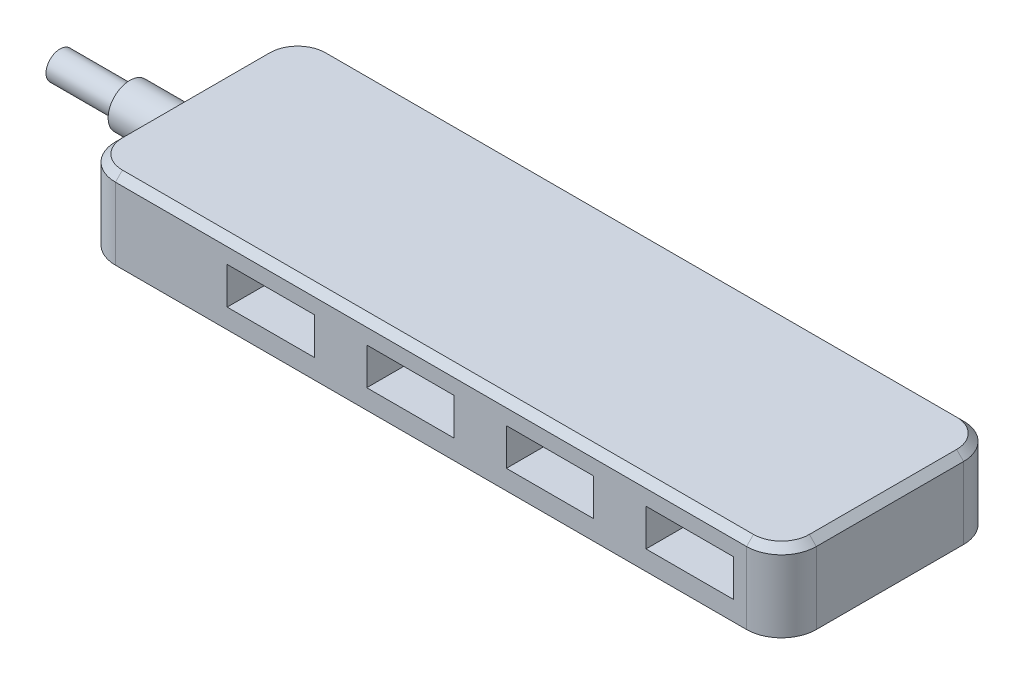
ISO-10303-21;
HEADER;
FILE_DESCRIPTION(('STEP AP214'),'2;1');
FILE_NAME('part.step','',(''),(''),'','','');
FILE_SCHEMA(('AUTOMOTIVE_DESIGN { 1 0 10303 214 1 1 1 1 }'));
ENDSEC;
DATA;
#1=APPLICATION_CONTEXT('core data for automotive mechanical design processes');
#2=APPLICATION_PROTOCOL_DEFINITION('international standard','automotive_design',2000,#1);
#3=PRODUCT_CONTEXT('',#1,'mechanical');
#4=PRODUCT('Part','Part','',(#3));
#5=PRODUCT_RELATED_PRODUCT_CATEGORY('part','',(#4));
#6=PRODUCT_DEFINITION_FORMATION('','',#4);
#7=PRODUCT_DEFINITION_CONTEXT('part definition',#1,'design');
#8=PRODUCT_DEFINITION('design','',#6,#7);
#9=PRODUCT_DEFINITION_SHAPE('','',#8);
#10=(LENGTH_UNIT() NAMED_UNIT(*) SI_UNIT(.MILLI.,.METRE.));
#11=(NAMED_UNIT(*) PLANE_ANGLE_UNIT() SI_UNIT($,.RADIAN.));
#12=(NAMED_UNIT(*) SI_UNIT($,.STERADIAN.) SOLID_ANGLE_UNIT());
#13=UNCERTAINTY_MEASURE_WITH_UNIT(LENGTH_MEASURE(1.E-05),#10,'distance_accuracy_value','');
#14=(GEOMETRIC_REPRESENTATION_CONTEXT(3) GLOBAL_UNCERTAINTY_ASSIGNED_CONTEXT((#13)) GLOBAL_UNIT_ASSIGNED_CONTEXT((#10,
#11,#12)) REPRESENTATION_CONTEXT('',''));
#15=CARTESIAN_POINT('',(0.,0.,0.));
#16=DIRECTION('',(0.,0.,1.));
#17=DIRECTION('',(1.,0.,0.));
#18=AXIS2_PLACEMENT_3D('',#15,#16,#17);
#19=CARTESIAN_POINT('',(50.2,11.3,15.55));
#20=DIRECTION('',(-1.,0.,0.));
#21=DIRECTION('',(0.,0.,1.));
#22=AXIS2_PLACEMENT_3D('',#19,#20,#21);
#23=PLANE('',#22);
#24=DIRECTION('',(0.,-1.,0.));
#25=VECTOR('',#24,1.);
#26=CARTESIAN_POINT('',(50.2,11.3,-10.55));
#27=LINE('',#26,#25);
#28=CARTESIAN_POINT('',(50.2,0.,-10.55));
#29=VERTEX_POINT('',#28);
#30=CARTESIAN_POINT('',(50.2,10.3,-10.55));
#31=VERTEX_POINT('',#30);
#32=EDGE_CURVE('E399',#29,#31,#27,.F.);
#33=ORIENTED_EDGE('',*,*,#32,.T.);
#34=DIRECTION('',(0.,0.,1.));
#35=VECTOR('',#34,1.);
#36=CARTESIAN_POINT('',(50.2,10.3,15.55));
#37=LINE('',#36,#35);
#38=CARTESIAN_POINT('',(50.2,10.3,10.55));
#39=VERTEX_POINT('',#38);
#40=EDGE_CURVE('E426',#31,#39,#37,.T.);
#41=ORIENTED_EDGE('',*,*,#40,.T.);
#42=DIRECTION('',(0.,-1.,0.));
#43=VECTOR('',#42,1.);
#44=CARTESIAN_POINT('',(50.2,11.3,10.55));
#45=LINE('',#44,#43);
#46=CARTESIAN_POINT('',(50.2,0.,10.55));
#47=VERTEX_POINT('',#46);
#48=EDGE_CURVE('E397',#39,#47,#45,.T.);
#49=ORIENTED_EDGE('',*,*,#48,.T.);
#50=DIRECTION('',(0.,0.,-1.));
#51=VECTOR('',#50,1.);
#52=CARTESIAN_POINT('',(50.2,0.,15.55));
#53=LINE('',#52,#51);
#54=EDGE_CURVE('E361',#47,#29,#53,.T.);
#55=ORIENTED_EDGE('',*,*,#54,.T.);
#56=EDGE_LOOP('',(#33,#41,#49,#55));
#57=FACE_BOUND('',#56,.T.);
#58=ADVANCED_FACE('F39',(#57),#23,.F.);
#59=CARTESIAN_POINT('',(-50.2,11.3,-15.55));
#60=DIRECTION('',(0.,0.,1.));
#61=DIRECTION('',(1.,0.,0.));
#62=AXIS2_PLACEMENT_3D('',#59,#60,#61);
#63=PLANE('',#62);
#64=DIRECTION('',(0.,-1.,0.));
#65=VECTOR('',#64,1.);
#66=CARTESIAN_POINT('',(-45.2,11.3,-15.55));
#67=LINE('',#66,#65);
#68=CARTESIAN_POINT('',(-45.2,0.,-15.55));
#69=VERTEX_POINT('',#68);
#70=CARTESIAN_POINT('',(-45.2,10.3,-15.55));
#71=VERTEX_POINT('',#70);
#72=EDGE_CURVE('E394',#69,#71,#67,.F.);
#73=ORIENTED_EDGE('',*,*,#72,.T.);
#74=DIRECTION('',(1.,0.,0.));
#75=VECTOR('',#74,1.);
#76=CARTESIAN_POINT('',(-50.2,10.3,-15.55));
#77=LINE('',#76,#75);
#78=CARTESIAN_POINT('',(45.2,10.3,-15.55));
#79=VERTEX_POINT('',#78);
#80=EDGE_CURVE('E422',#71,#79,#77,.T.);
#81=ORIENTED_EDGE('',*,*,#80,.T.);
#82=DIRECTION('',(0.,-1.,0.));
#83=VECTOR('',#82,1.);
#84=CARTESIAN_POINT('',(45.2,11.3,-15.55));
#85=LINE('',#84,#83);
#86=CARTESIAN_POINT('',(45.2,0.,-15.55));
#87=VERTEX_POINT('',#86);
#88=EDGE_CURVE('E392',#79,#87,#85,.T.);
#89=ORIENTED_EDGE('',*,*,#88,.T.);
#90=DIRECTION('',(-1.,0.,0.));
#91=VECTOR('',#90,1.);
#92=CARTESIAN_POINT('',(-50.2,0.,-15.55));
#93=LINE('',#92,#91);
#94=EDGE_CURVE('E364',#87,#69,#93,.T.);
#95=ORIENTED_EDGE('',*,*,#94,.T.);
#96=EDGE_LOOP('',(#73,#81,#89,#95));
#97=FACE_BOUND('',#96,.T.);
#98=ADVANCED_FACE('F519',(#97),#63,.F.);
#99=CARTESIAN_POINT('',(-50.2,11.3,15.55));
#100=DIRECTION('',(1.,0.,0.));
#101=DIRECTION('',(0.,0.,-1.));
#102=AXIS2_PLACEMENT_3D('',#99,#100,#101);
#103=PLANE('',#102);
#104=CARTESIAN_POINT('',(-50.2,5.3,0.));
#105=DIRECTION('',(1.,0.,0.));
#106=DIRECTION('',(0.,0.,-1.));
#107=AXIS2_PLACEMENT_3D('',#104,#105,#106);
#108=CIRCLE('',#107,3.1);
#109=CARTESIAN_POINT('',(-50.2,5.3,-3.1));
#110=VERTEX_POINT('',#109);
#111=EDGE_CURVE('E44',#110,#110,#108,.F.);
#112=ORIENTED_EDGE('',*,*,#111,.F.);
#113=EDGE_LOOP('',(#112));
#114=FACE_BOUND('',#113,.T.);
#115=DIRECTION('',(0.,-1.,0.));
#116=VECTOR('',#115,1.);
#117=CARTESIAN_POINT('',(-50.2,11.3,10.55));
#118=LINE('',#117,#116);
#119=CARTESIAN_POINT('',(-50.2,0.,10.55));
#120=VERTEX_POINT('',#119);
#121=CARTESIAN_POINT('',(-50.2,10.3,10.55));
#122=VERTEX_POINT('',#121);
#123=EDGE_CURVE('E389',#120,#122,#118,.F.);
#124=ORIENTED_EDGE('',*,*,#123,.T.);
#125=DIRECTION('',(0.,0.,-1.));
#126=VECTOR('',#125,1.);
#127=CARTESIAN_POINT('',(-50.2,10.3,15.55));
#128=LINE('',#127,#126);
#129=CARTESIAN_POINT('',(-50.2,10.3,-10.55));
#130=VERTEX_POINT('',#129);
#131=EDGE_CURVE('E434',#122,#130,#128,.T.);
#132=ORIENTED_EDGE('',*,*,#131,.T.);
#133=DIRECTION('',(0.,-1.,0.));
#134=VECTOR('',#133,1.);
#135=CARTESIAN_POINT('',(-50.2,11.3,-10.55));
#136=LINE('',#135,#134);
#137=CARTESIAN_POINT('',(-50.2,0.,-10.55));
#138=VERTEX_POINT('',#137);
#139=EDGE_CURVE('E387',#130,#138,#136,.T.);
#140=ORIENTED_EDGE('',*,*,#139,.T.);
#141=DIRECTION('',(0.,0.,1.));
#142=VECTOR('',#141,1.);
#143=CARTESIAN_POINT('',(-50.2,0.,15.55));
#144=LINE('',#143,#142);
#145=EDGE_CURVE('E368',#138,#120,#144,.T.);
#146=ORIENTED_EDGE('',*,*,#145,.T.);
#147=EDGE_LOOP('',(#124,#132,#140,#146));
#148=FACE_BOUND('',#147,.T.);
#149=ADVANCED_FACE('F513',(#114,#148),#103,.F.);
#150=CARTESIAN_POINT('',(-50.2,11.3,15.55));
#151=DIRECTION('',(0.,0.,-1.));
#152=DIRECTION('',(-1.,0.,0.));
#153=AXIS2_PLACEMENT_3D('',#150,#151,#152);
#154=PLANE('',#153);
#155=DIRECTION('',(-1.,0.,0.));
#156=VECTOR('',#155,1.);
#157=CARTESIAN_POINT('',(-29.2,8.1,15.55));
#158=LINE('',#157,#156);
#159=CARTESIAN_POINT('',(-16.7,8.1,15.55));
#160=VERTEX_POINT('',#159);
#161=CARTESIAN_POINT('',(-29.2,8.1,15.55));
#162=VERTEX_POINT('',#161);
#163=EDGE_CURVE('E257',#160,#162,#158,.T.);
#164=ORIENTED_EDGE('',*,*,#163,.F.);
#165=DIRECTION('',(0.,1.,0.));
#166=VECTOR('',#165,1.);
#167=CARTESIAN_POINT('',(-16.7,2.8,15.55));
#168=LINE('',#167,#166);
#169=CARTESIAN_POINT('',(-16.7,2.8,15.55));
#170=VERTEX_POINT('',#169);
#171=EDGE_CURVE('E56',#170,#160,#168,.T.);
#172=ORIENTED_EDGE('',*,*,#171,.F.);
#173=DIRECTION('',(1.,0.,0.));
#174=VECTOR('',#173,1.);
#175=CARTESIAN_POINT('',(-29.2,2.8,15.55));
#176=LINE('',#175,#174);
#177=CARTESIAN_POINT('',(-29.2,2.8,15.55));
#178=VERTEX_POINT('',#177);
#179=EDGE_CURVE('E246',#178,#170,#176,.T.);
#180=ORIENTED_EDGE('',*,*,#179,.F.);
#181=DIRECTION('',(0.,-1.,0.));
#182=VECTOR('',#181,1.);
#183=CARTESIAN_POINT('',(-29.2,2.8,15.55));
#184=LINE('',#183,#182);
#185=EDGE_CURVE('E249',#162,#178,#184,.T.);
#186=ORIENTED_EDGE('',*,*,#185,.F.);
#187=EDGE_LOOP('',(#164,#172,#180,#186));
#188=FACE_BOUND('',#187,.T.);
#189=DIRECTION('',(0.,-1.,0.));
#190=VECTOR('',#189,1.);
#191=CARTESIAN_POINT('',(-9.20000000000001,2.8,15.55));
#192=LINE('',#191,#190);
#193=CARTESIAN_POINT('',(-9.20000000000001,8.1,15.55));
#194=VERTEX_POINT('',#193);
#195=CARTESIAN_POINT('',(-9.20000000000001,2.8,15.55));
#196=VERTEX_POINT('',#195);
#197=EDGE_CURVE('E284',#194,#196,#192,.T.);
#198=ORIENTED_EDGE('',*,*,#197,.F.);
#199=DIRECTION('',(-1.,0.,0.));
#200=VECTOR('',#199,1.);
#201=CARTESIAN_POINT('',(-9.20000000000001,8.1,15.55));
#202=LINE('',#201,#200);
#203=CARTESIAN_POINT('',(3.29999999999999,8.1,15.55));
#204=VERTEX_POINT('',#203);
#205=EDGE_CURVE('E64',#204,#194,#202,.T.);
#206=ORIENTED_EDGE('',*,*,#205,.F.);
#207=DIRECTION('',(0.,1.,0.));
#208=VECTOR('',#207,1.);
#209=CARTESIAN_POINT('',(3.29999999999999,2.8,15.55));
#210=LINE('',#209,#208);
#211=CARTESIAN_POINT('',(3.29999999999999,2.8,15.55));
#212=VERTEX_POINT('',#211);
#213=EDGE_CURVE('E277',#212,#204,#210,.T.);
#214=ORIENTED_EDGE('',*,*,#213,.F.);
#215=DIRECTION('',(1.,0.,0.));
#216=VECTOR('',#215,1.);
#217=CARTESIAN_POINT('',(-9.20000000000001,2.8,15.55));
#218=LINE('',#217,#216);
#219=EDGE_CURVE('E280',#196,#212,#218,.T.);
#220=ORIENTED_EDGE('',*,*,#219,.F.);
#221=EDGE_LOOP('',(#198,#206,#214,#220));
#222=FACE_BOUND('',#221,.T.);
#223=DIRECTION('',(0.,-1.,0.));
#224=VECTOR('',#223,1.);
#225=CARTESIAN_POINT('',(10.8,2.8,15.55));
#226=LINE('',#225,#224);
#227=CARTESIAN_POINT('',(10.8,8.1,15.55));
#228=VERTEX_POINT('',#227);
#229=CARTESIAN_POINT('',(10.8,2.8,15.55));
#230=VERTEX_POINT('',#229);
#231=EDGE_CURVE('E316',#228,#230,#226,.T.);
#232=ORIENTED_EDGE('',*,*,#231,.F.);
#233=DIRECTION('',(-1.,0.,0.));
#234=VECTOR('',#233,1.);
#235=CARTESIAN_POINT('',(10.8,8.1,15.55));
#236=LINE('',#235,#234);
#237=CARTESIAN_POINT('',(23.3,8.1,15.55));
#238=VERTEX_POINT('',#237);
#239=EDGE_CURVE('E276',#238,#228,#236,.T.);
#240=ORIENTED_EDGE('',*,*,#239,.F.);
#241=DIRECTION('',(0.,1.,0.));
#242=VECTOR('',#241,1.);
#243=CARTESIAN_POINT('',(23.3,2.8,15.55));
#244=LINE('',#243,#242);
#245=CARTESIAN_POINT('',(23.3,2.8,15.55));
#246=VERTEX_POINT('',#245);
#247=EDGE_CURVE('E309',#246,#238,#244,.T.);
#248=ORIENTED_EDGE('',*,*,#247,.F.);
#249=DIRECTION('',(1.,0.,0.));
#250=VECTOR('',#249,1.);
#251=CARTESIAN_POINT('',(10.8,2.8,15.55));
#252=LINE('',#251,#250);
#253=EDGE_CURVE('E312',#230,#246,#252,.T.);
#254=ORIENTED_EDGE('',*,*,#253,.F.);
#255=EDGE_LOOP('',(#232,#240,#248,#254));
#256=FACE_BOUND('',#255,.T.);
#257=DIRECTION('',(0.,-1.,0.));
#258=VECTOR('',#257,1.);
#259=CARTESIAN_POINT('',(30.8,2.8,15.55));
#260=LINE('',#259,#258);
#261=CARTESIAN_POINT('',(30.8,8.1,15.55));
#262=VERTEX_POINT('',#261);
#263=CARTESIAN_POINT('',(30.8,2.8,15.55));
#264=VERTEX_POINT('',#263);
#265=EDGE_CURVE('E347',#262,#264,#260,.T.);
#266=ORIENTED_EDGE('',*,*,#265,.F.);
#267=DIRECTION('',(-1.,0.,0.));
#268=VECTOR('',#267,1.);
#269=CARTESIAN_POINT('',(30.8,8.1,15.55));
#270=LINE('',#269,#268);
#271=CARTESIAN_POINT('',(43.3,8.1,15.55));
#272=VERTEX_POINT('',#271);
#273=EDGE_CURVE('E308',#272,#262,#270,.T.);
#274=ORIENTED_EDGE('',*,*,#273,.F.);
#275=DIRECTION('',(0.,1.,0.));
#276=VECTOR('',#275,1.);
#277=CARTESIAN_POINT('',(43.3,2.8,15.55));
#278=LINE('',#277,#276);
#279=CARTESIAN_POINT('',(43.3,2.8,15.55));
#280=VERTEX_POINT('',#279);
#281=EDGE_CURVE('E340',#280,#272,#278,.T.);
#282=ORIENTED_EDGE('',*,*,#281,.F.);
#283=DIRECTION('',(1.,0.,0.));
#284=VECTOR('',#283,1.);
#285=CARTESIAN_POINT('',(30.8,2.8,15.55));
#286=LINE('',#285,#284);
#287=EDGE_CURVE('E343',#264,#280,#286,.T.);
#288=ORIENTED_EDGE('',*,*,#287,.F.);
#289=EDGE_LOOP('',(#266,#274,#282,#288));
#290=FACE_BOUND('',#289,.T.);
#291=DIRECTION('',(0.,-1.,0.));
#292=VECTOR('',#291,1.);
#293=CARTESIAN_POINT('',(45.2,11.3,15.55));
#294=LINE('',#293,#292);
#295=CARTESIAN_POINT('',(45.2,0.,15.55));
#296=VERTEX_POINT('',#295);
#297=CARTESIAN_POINT('',(45.2,10.3,15.55));
#298=VERTEX_POINT('',#297);
#299=EDGE_CURVE('E374',#296,#298,#294,.F.);
#300=ORIENTED_EDGE('',*,*,#299,.T.);
#301=DIRECTION('',(-1.,0.,0.));
#302=VECTOR('',#301,1.);
#303=CARTESIAN_POINT('',(-50.2,10.3,15.55));
#304=LINE('',#303,#302);
#305=CARTESIAN_POINT('',(-45.2,10.3,15.55));
#306=VERTEX_POINT('',#305);
#307=EDGE_CURVE('E430',#298,#306,#304,.T.);
#308=ORIENTED_EDGE('',*,*,#307,.T.);
#309=DIRECTION('',(0.,-1.,0.));
#310=VECTOR('',#309,1.);
#311=CARTESIAN_POINT('',(-45.2,11.3,15.55));
#312=LINE('',#311,#310);
#313=CARTESIAN_POINT('',(-45.2,0.,15.55));
#314=VERTEX_POINT('',#313);
#315=EDGE_CURVE('E377',#306,#314,#312,.T.);
#316=ORIENTED_EDGE('',*,*,#315,.T.);
#317=DIRECTION('',(1.,0.,0.));
#318=VECTOR('',#317,1.);
#319=CARTESIAN_POINT('',(-50.2,0.,15.55));
#320=LINE('',#319,#318);
#321=EDGE_CURVE('E371',#314,#296,#320,.T.);
#322=ORIENTED_EDGE('',*,*,#321,.T.);
#323=EDGE_LOOP('',(#300,#308,#316,#322));
#324=FACE_BOUND('',#323,.T.);
#325=ADVANCED_FACE('F471',(#188,#222,#256,#290,#324),#154,.F.);
#326=CARTESIAN_POINT('',(0.,11.3,0.));
#327=DIRECTION('',(0.,-1.,0.));
#328=DIRECTION('',(0.,0.,-1.));
#329=AXIS2_PLACEMENT_3D('',#326,#327,#328);
#330=PLANE('',#329);
#331=DIRECTION('',(-1.,0.,0.));
#332=VECTOR('',#331,1.);
#333=CARTESIAN_POINT('',(0.,11.3,-14.55));
#334=LINE('',#333,#332);
#335=CARTESIAN_POINT('',(45.2,11.3,-14.55));
#336=VERTEX_POINT('',#335);
#337=CARTESIAN_POINT('',(-45.2,11.3,-14.55));
#338=VERTEX_POINT('',#337);
#339=EDGE_CURVE('E414',#336,#338,#334,.T.);
#340=ORIENTED_EDGE('',*,*,#339,.T.);
#341=CARTESIAN_POINT('',(-45.2,11.3,-10.55));
#342=DIRECTION('',(0.,-1.,0.));
#343=DIRECTION('',(0.,0.,-1.));
#344=AXIS2_PLACEMENT_3D('',#341,#342,#343);
#345=CIRCLE('',#344,4.00000000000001);
#346=CARTESIAN_POINT('',(-49.2,11.3,-10.55));
#347=VERTEX_POINT('',#346);
#348=EDGE_CURVE('E416',#338,#347,#345,.F.);
#349=ORIENTED_EDGE('',*,*,#348,.T.);
#350=DIRECTION('',(0.,0.,1.));
#351=VECTOR('',#350,1.);
#352=CARTESIAN_POINT('',(-49.2,11.3,0.));
#353=LINE('',#352,#351);
#354=CARTESIAN_POINT('',(-49.2,11.3,10.55));
#355=VERTEX_POINT('',#354);
#356=EDGE_CURVE('E402',#347,#355,#353,.T.);
#357=ORIENTED_EDGE('',*,*,#356,.T.);
#358=CARTESIAN_POINT('',(-45.2,11.3,10.55));
#359=DIRECTION('',(0.,-1.,0.));
#360=DIRECTION('',(0.,0.,-1.));
#361=AXIS2_PLACEMENT_3D('',#358,#359,#360);
#362=CIRCLE('',#361,4.00000000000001);
#363=CARTESIAN_POINT('',(-45.2,11.3,14.55));
#364=VERTEX_POINT('',#363);
#365=EDGE_CURVE('E404',#355,#364,#362,.F.);
#366=ORIENTED_EDGE('',*,*,#365,.T.);
#367=DIRECTION('',(1.,0.,0.));
#368=VECTOR('',#367,1.);
#369=CARTESIAN_POINT('',(0.,11.3,14.55));
#370=LINE('',#369,#368);
#371=CARTESIAN_POINT('',(45.2,11.3,14.55));
#372=VERTEX_POINT('',#371);
#373=EDGE_CURVE('E406',#364,#372,#370,.T.);
#374=ORIENTED_EDGE('',*,*,#373,.T.);
#375=CARTESIAN_POINT('',(45.2,11.3,10.55));
#376=DIRECTION('',(0.,-1.,0.));
#377=DIRECTION('',(0.,0.,-1.));
#378=AXIS2_PLACEMENT_3D('',#375,#376,#377);
#379=CIRCLE('',#378,4.00000000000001);
#380=CARTESIAN_POINT('',(49.2,11.3,10.55));
#381=VERTEX_POINT('',#380);
#382=EDGE_CURVE('E408',#372,#381,#379,.F.);
#383=ORIENTED_EDGE('',*,*,#382,.T.);
#384=DIRECTION('',(0.,0.,-1.));
#385=VECTOR('',#384,1.);
#386=CARTESIAN_POINT('',(49.2,11.3,0.));
#387=LINE('',#386,#385);
#388=CARTESIAN_POINT('',(49.2,11.3,-10.55));
#389=VERTEX_POINT('',#388);
#390=EDGE_CURVE('E410',#381,#389,#387,.T.);
#391=ORIENTED_EDGE('',*,*,#390,.T.);
#392=CARTESIAN_POINT('',(45.2,11.3,-10.55));
#393=DIRECTION('',(0.,-1.,0.));
#394=DIRECTION('',(0.,0.,-1.));
#395=AXIS2_PLACEMENT_3D('',#392,#393,#394);
#396=CIRCLE('',#395,4.00000000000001);
#397=EDGE_CURVE('E412',#389,#336,#396,.F.);
#398=ORIENTED_EDGE('',*,*,#397,.T.);
#399=EDGE_LOOP('',(#340,#349,#357,#366,#374,#383,#391,#398));
#400=FACE_BOUND('',#399,.T.);
#401=ADVANCED_FACE('F498',(#400),#330,.F.);
#402=CARTESIAN_POINT('',(0.,0.,0.));
#403=DIRECTION('',(0.,-1.,0.));
#404=DIRECTION('',(0.,0.,-1.));
#405=AXIS2_PLACEMENT_3D('',#402,#403,#404);
#406=PLANE('',#405);
#407=ORIENTED_EDGE('',*,*,#321,.F.);
#408=CARTESIAN_POINT('',(-45.2,0.,10.55));
#409=DIRECTION('',(0.,-1.,0.));
#410=DIRECTION('',(0.,0.,-1.));
#411=AXIS2_PLACEMENT_3D('',#408,#409,#410);
#412=CIRCLE('',#411,5.);
#413=EDGE_CURVE('E385',#314,#120,#412,.T.);
#414=ORIENTED_EDGE('',*,*,#413,.T.);
#415=ORIENTED_EDGE('',*,*,#145,.F.);
#416=CARTESIAN_POINT('',(-45.2,0.,-10.55));
#417=DIRECTION('',(0.,-1.,0.));
#418=DIRECTION('',(0.,0.,-1.));
#419=AXIS2_PLACEMENT_3D('',#416,#417,#418);
#420=CIRCLE('',#419,5.);
#421=EDGE_CURVE('E383',#138,#69,#420,.T.);
#422=ORIENTED_EDGE('',*,*,#421,.T.);
#423=ORIENTED_EDGE('',*,*,#94,.F.);
#424=CARTESIAN_POINT('',(45.2,0.,-10.55));
#425=DIRECTION('',(0.,-1.,0.));
#426=DIRECTION('',(0.,0.,-1.));
#427=AXIS2_PLACEMENT_3D('',#424,#425,#426);
#428=CIRCLE('',#427,5.);
#429=EDGE_CURVE('E381',#87,#29,#428,.T.);
#430=ORIENTED_EDGE('',*,*,#429,.T.);
#431=ORIENTED_EDGE('',*,*,#54,.F.);
#432=CARTESIAN_POINT('',(45.2,0.,10.55));
#433=DIRECTION('',(0.,-1.,0.));
#434=DIRECTION('',(0.,0.,-1.));
#435=AXIS2_PLACEMENT_3D('',#432,#433,#434);
#436=CIRCLE('',#435,5.);
#437=EDGE_CURVE('E379',#47,#296,#436,.T.);
#438=ORIENTED_EDGE('',*,*,#437,.T.);
#439=EDGE_LOOP('',(#407,#414,#415,#422,#423,#430,#431,#438));
#440=FACE_BOUND('',#439,.T.);
#441=ADVANCED_FACE('F476',(#440),#406,.T.);
#442=CARTESIAN_POINT('',(-45.2,11.3,10.55));
#443=DIRECTION('',(0.,-1.,0.));
#444=DIRECTION('',(0.,0.,-1.));
#445=AXIS2_PLACEMENT_3D('',#442,#443,#444);
#446=CYLINDRICAL_SURFACE('',#445,5.);
#447=ORIENTED_EDGE('',*,*,#315,.F.);
#448=CARTESIAN_POINT('',(-45.2,10.3,10.55));
#449=DIRECTION('',(0.,-1.,0.));
#450=DIRECTION('',(0.,0.,-1.));
#451=AXIS2_PLACEMENT_3D('',#448,#449,#450);
#452=CIRCLE('',#451,5.);
#453=EDGE_CURVE('E432',#306,#122,#452,.T.);
#454=ORIENTED_EDGE('',*,*,#453,.T.);
#455=ORIENTED_EDGE('',*,*,#123,.F.);
#456=ORIENTED_EDGE('',*,*,#413,.F.);
#457=EDGE_LOOP('',(#447,#454,#455,#456));
#458=FACE_BOUND('',#457,.T.);
#459=ADVANCED_FACE('F511',(#458),#446,.T.);
#460=CARTESIAN_POINT('',(-45.2,11.3,-10.55));
#461=DIRECTION('',(0.,-1.,0.));
#462=DIRECTION('',(0.,0.,-1.));
#463=AXIS2_PLACEMENT_3D('',#460,#461,#462);
#464=CYLINDRICAL_SURFACE('',#463,5.);
#465=ORIENTED_EDGE('',*,*,#139,.F.);
#466=CARTESIAN_POINT('',(-45.2,10.3,-10.55));
#467=DIRECTION('',(0.,-1.,0.));
#468=DIRECTION('',(0.,0.,-1.));
#469=AXIS2_PLACEMENT_3D('',#466,#467,#468);
#470=CIRCLE('',#469,5.);
#471=EDGE_CURVE('E419',#130,#71,#470,.T.);
#472=ORIENTED_EDGE('',*,*,#471,.T.);
#473=ORIENTED_EDGE('',*,*,#72,.F.);
#474=ORIENTED_EDGE('',*,*,#421,.F.);
#475=EDGE_LOOP('',(#465,#472,#473,#474));
#476=FACE_BOUND('',#475,.T.);
#477=ADVANCED_FACE('F520',(#476),#464,.T.);
#478=CARTESIAN_POINT('',(45.2,11.3,-10.55));
#479=DIRECTION('',(0.,-1.,0.));
#480=DIRECTION('',(0.,0.,-1.));
#481=AXIS2_PLACEMENT_3D('',#478,#479,#480);
#482=CYLINDRICAL_SURFACE('',#481,5.);
#483=ORIENTED_EDGE('',*,*,#88,.F.);
#484=CARTESIAN_POINT('',(45.2,10.3,-10.55));
#485=DIRECTION('',(0.,-1.,0.));
#486=DIRECTION('',(0.,0.,-1.));
#487=AXIS2_PLACEMENT_3D('',#484,#485,#486);
#488=CIRCLE('',#487,5.);
#489=EDGE_CURVE('E424',#79,#31,#488,.T.);
#490=ORIENTED_EDGE('',*,*,#489,.T.);
#491=ORIENTED_EDGE('',*,*,#32,.F.);
#492=ORIENTED_EDGE('',*,*,#429,.F.);
#493=EDGE_LOOP('',(#483,#490,#491,#492));
#494=FACE_BOUND('',#493,.T.);
#495=ADVANCED_FACE('F485',(#494),#482,.T.);
#496=CARTESIAN_POINT('',(45.2,11.3,10.55));
#497=DIRECTION('',(0.,-1.,0.));
#498=DIRECTION('',(0.,0.,-1.));
#499=AXIS2_PLACEMENT_3D('',#496,#497,#498);
#500=CYLINDRICAL_SURFACE('',#499,5.);
#501=ORIENTED_EDGE('',*,*,#48,.F.);
#502=CARTESIAN_POINT('',(45.2,10.3,10.55));
#503=DIRECTION('',(0.,-1.,0.));
#504=DIRECTION('',(0.,0.,-1.));
#505=AXIS2_PLACEMENT_3D('',#502,#503,#504);
#506=CIRCLE('',#505,5.);
#507=EDGE_CURVE('E428',#39,#298,#506,.T.);
#508=ORIENTED_EDGE('',*,*,#507,.T.);
#509=ORIENTED_EDGE('',*,*,#299,.F.);
#510=ORIENTED_EDGE('',*,*,#437,.F.);
#511=EDGE_LOOP('',(#501,#508,#509,#510));
#512=FACE_BOUND('',#511,.T.);
#513=ADVANCED_FACE('F468',(#512),#500,.T.);
#514=CARTESIAN_POINT('',(45.2,11.3,10.55));
#515=DIRECTION('',(0.,-1.,0.));
#516=DIRECTION('',(0.,0.,-1.));
#517=AXIS2_PLACEMENT_3D('',#514,#515,#516);
#518=CONICAL_SURFACE('',#517,4.00000000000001,0.785398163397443);
#519=DIRECTION('',(0.,0.707106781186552,-0.707106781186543));
#520=VECTOR('',#519,1.);
#521=CARTESIAN_POINT('',(45.2,10.3,15.55));
#522=LINE('',#521,#520);
#523=EDGE_CURVE('E451',#298,#372,#522,.T.);
#524=ORIENTED_EDGE('',*,*,#523,.F.);
#525=ORIENTED_EDGE('',*,*,#507,.F.);
#526=DIRECTION('',(0.707106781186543,-0.707106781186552,0.));
#527=VECTOR('',#526,1.);
#528=CARTESIAN_POINT('',(49.2,11.3,10.55));
#529=LINE('',#528,#527);
#530=EDGE_CURVE('E365',#381,#39,#529,.T.);
#531=ORIENTED_EDGE('',*,*,#530,.F.);
#532=ORIENTED_EDGE('',*,*,#382,.F.);
#533=EDGE_LOOP('',(#524,#525,#531,#532));
#534=FACE_BOUND('',#533,.T.);
#535=ADVANCED_FACE('F42',(#534),#518,.T.);
#536=CARTESIAN_POINT('',(49.2,11.3,0.));
#537=DIRECTION('',(-0.707106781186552,-0.707106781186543,0.));
#538=DIRECTION('',(0.,0.,-1.));
#539=AXIS2_PLACEMENT_3D('',#536,#537,#538);
#540=PLANE('',#539);
#541=ORIENTED_EDGE('',*,*,#530,.T.);
#542=ORIENTED_EDGE('',*,*,#40,.F.);
#543=DIRECTION('',(0.707106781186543,-0.707106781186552,0.));
#544=VECTOR('',#543,1.);
#545=CARTESIAN_POINT('',(49.2,11.3,-10.55));
#546=LINE('',#545,#544);
#547=EDGE_CURVE('E448',#389,#31,#546,.T.);
#548=ORIENTED_EDGE('',*,*,#547,.F.);
#549=ORIENTED_EDGE('',*,*,#390,.F.);
#550=EDGE_LOOP('',(#541,#542,#548,#549));
#551=FACE_BOUND('',#550,.T.);
#552=ADVANCED_FACE('F458',(#551),#540,.F.);
#553=CARTESIAN_POINT('',(0.,11.3,14.55));
#554=DIRECTION('',(0.,-0.707106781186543,-0.707106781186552));
#555=DIRECTION('',(1.,0.,0.));
#556=AXIS2_PLACEMENT_3D('',#553,#554,#555);
#557=PLANE('',#556);
#558=ORIENTED_EDGE('',*,*,#523,.T.);
#559=ORIENTED_EDGE('',*,*,#373,.F.);
#560=DIRECTION('',(0.,0.707106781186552,-0.707106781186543));
#561=VECTOR('',#560,1.);
#562=CARTESIAN_POINT('',(-45.2,10.3,15.55));
#563=LINE('',#562,#561);
#564=EDGE_CURVE('E445',#306,#364,#563,.T.);
#565=ORIENTED_EDGE('',*,*,#564,.F.);
#566=ORIENTED_EDGE('',*,*,#307,.F.);
#567=EDGE_LOOP('',(#558,#559,#565,#566));
#568=FACE_BOUND('',#567,.T.);
#569=ADVANCED_FACE('F503',(#568),#557,.F.);
#570=CARTESIAN_POINT('',(45.2,11.3,-10.55));
#571=DIRECTION('',(0.,-1.,0.));
#572=DIRECTION('',(0.,0.,-1.));
#573=AXIS2_PLACEMENT_3D('',#570,#571,#572);
#574=CONICAL_SURFACE('',#573,4.00000000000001,0.785398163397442);
#575=ORIENTED_EDGE('',*,*,#547,.T.);
#576=ORIENTED_EDGE('',*,*,#489,.F.);
#577=DIRECTION('',(0.,-0.707106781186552,-0.707106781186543));
#578=VECTOR('',#577,1.);
#579=CARTESIAN_POINT('',(45.2,11.3,-14.55));
#580=LINE('',#579,#578);
#581=EDGE_CURVE('E442',#336,#79,#580,.T.);
#582=ORIENTED_EDGE('',*,*,#581,.F.);
#583=ORIENTED_EDGE('',*,*,#397,.F.);
#584=EDGE_LOOP('',(#575,#576,#582,#583));
#585=FACE_BOUND('',#584,.T.);
#586=ADVANCED_FACE('F489',(#585),#574,.T.);
#587=CARTESIAN_POINT('',(-45.2,11.3,10.55));
#588=DIRECTION('',(0.,-1.,0.));
#589=DIRECTION('',(0.,0.,-1.));
#590=AXIS2_PLACEMENT_3D('',#587,#588,#589);
#591=CONICAL_SURFACE('',#590,4.00000000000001,0.785398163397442);
#592=ORIENTED_EDGE('',*,*,#564,.T.);
#593=ORIENTED_EDGE('',*,*,#365,.F.);
#594=DIRECTION('',(0.707106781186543,0.707106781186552,0.));
#595=VECTOR('',#594,1.);
#596=CARTESIAN_POINT('',(-50.2,10.3,10.55));
#597=LINE('',#596,#595);
#598=EDGE_CURVE('E439',#122,#355,#597,.T.);
#599=ORIENTED_EDGE('',*,*,#598,.F.);
#600=ORIENTED_EDGE('',*,*,#453,.F.);
#601=EDGE_LOOP('',(#592,#593,#599,#600));
#602=FACE_BOUND('',#601,.T.);
#603=ADVANCED_FACE('F506',(#602),#591,.T.);
#604=CARTESIAN_POINT('',(0.,11.3,-14.55));
#605=DIRECTION('',(0.,-0.707106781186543,0.707106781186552));
#606=DIRECTION('',(-1.,0.,0.));
#607=AXIS2_PLACEMENT_3D('',#604,#605,#606);
#608=PLANE('',#607);
#609=ORIENTED_EDGE('',*,*,#581,.T.);
#610=ORIENTED_EDGE('',*,*,#80,.F.);
#611=DIRECTION('',(0.,-0.707106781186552,-0.707106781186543));
#612=VECTOR('',#611,1.);
#613=CARTESIAN_POINT('',(-45.2,11.3,-14.55));
#614=LINE('',#613,#612);
#615=EDGE_CURVE('E437',#338,#71,#614,.T.);
#616=ORIENTED_EDGE('',*,*,#615,.F.);
#617=ORIENTED_EDGE('',*,*,#339,.F.);
#618=EDGE_LOOP('',(#609,#610,#616,#617));
#619=FACE_BOUND('',#618,.T.);
#620=ADVANCED_FACE('F494',(#619),#608,.F.);
#621=CARTESIAN_POINT('',(-49.2,11.3,0.));
#622=DIRECTION('',(0.707106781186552,-0.707106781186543,0.));
#623=DIRECTION('',(0.,0.,1.));
#624=AXIS2_PLACEMENT_3D('',#621,#622,#623);
#625=PLANE('',#624);
#626=ORIENTED_EDGE('',*,*,#598,.T.);
#627=ORIENTED_EDGE('',*,*,#356,.F.);
#628=DIRECTION('',(0.707106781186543,0.707106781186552,0.));
#629=VECTOR('',#628,1.);
#630=CARTESIAN_POINT('',(-50.2,10.3,-10.55));
#631=LINE('',#630,#629);
#632=EDGE_CURVE('E263',#130,#347,#631,.T.);
#633=ORIENTED_EDGE('',*,*,#632,.F.);
#634=ORIENTED_EDGE('',*,*,#131,.F.);
#635=EDGE_LOOP('',(#626,#627,#633,#634));
#636=FACE_BOUND('',#635,.T.);
#637=ADVANCED_FACE('F527',(#636),#625,.F.);
#638=CARTESIAN_POINT('',(-45.2,11.3,-10.55));
#639=DIRECTION('',(0.,-1.,0.));
#640=DIRECTION('',(0.,0.,-1.));
#641=AXIS2_PLACEMENT_3D('',#638,#639,#640);
#642=CONICAL_SURFACE('',#641,4.00000000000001,0.785398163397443);
#643=ORIENTED_EDGE('',*,*,#615,.T.);
#644=ORIENTED_EDGE('',*,*,#471,.F.);
#645=ORIENTED_EDGE('',*,*,#632,.T.);
#646=ORIENTED_EDGE('',*,*,#348,.F.);
#647=EDGE_LOOP('',(#643,#644,#645,#646));
#648=FACE_BOUND('',#647,.T.);
#649=ADVANCED_FACE('F524',(#648),#642,.T.);
#650=CARTESIAN_POINT('',(30.8,8.1,2.55));
#651=DIRECTION('',(0.,1.,0.));
#652=DIRECTION('',(-1.,0.,0.));
#653=AXIS2_PLACEMENT_3D('',#650,#651,#652);
#654=PLANE('',#653);
#655=ORIENTED_EDGE('',*,*,#273,.T.);
#656=DIRECTION('',(0.,0.,1.));
#657=VECTOR('',#656,1.);
#658=CARTESIAN_POINT('',(30.8,8.1,2.55));
#659=LINE('',#658,#657);
#660=CARTESIAN_POINT('',(30.8,8.1,2.55));
#661=VERTEX_POINT('',#660);
#662=EDGE_CURVE('E330',#661,#262,#659,.T.);
#663=ORIENTED_EDGE('',*,*,#662,.F.);
#664=DIRECTION('',(-1.,0.,0.));
#665=VECTOR('',#664,1.);
#666=CARTESIAN_POINT('',(30.8,8.1,2.55));
#667=LINE('',#666,#665);
#668=CARTESIAN_POINT('',(43.3,8.1,2.55));
#669=VERTEX_POINT('',#668);
#670=EDGE_CURVE('E344',#669,#661,#667,.T.);
#671=ORIENTED_EDGE('',*,*,#670,.F.);
#672=DIRECTION('',(0.,0.,1.));
#673=VECTOR('',#672,1.);
#674=CARTESIAN_POINT('',(43.3,8.1,2.55));
#675=LINE('',#674,#673);
#676=EDGE_CURVE('E338',#669,#272,#675,.T.);
#677=ORIENTED_EDGE('',*,*,#676,.T.);
#678=EDGE_LOOP('',(#655,#663,#671,#677));
#679=FACE_BOUND('',#678,.T.);
#680=ADVANCED_FACE('F534',(#679),#654,.F.);
#681=CARTESIAN_POINT('',(43.3,2.8,2.55));
#682=DIRECTION('',(1.,0.,0.));
#683=DIRECTION('',(0.,0.,-1.));
#684=AXIS2_PLACEMENT_3D('',#681,#682,#683);
#685=PLANE('',#684);
#686=ORIENTED_EDGE('',*,*,#281,.T.);
#687=ORIENTED_EDGE('',*,*,#676,.F.);
#688=DIRECTION('',(0.,1.,0.));
#689=VECTOR('',#688,1.);
#690=CARTESIAN_POINT('',(43.3,2.8,2.55));
#691=LINE('',#690,#689);
#692=CARTESIAN_POINT('',(43.3,2.8,2.55));
#693=VERTEX_POINT('',#692);
#694=EDGE_CURVE('E333',#693,#669,#691,.T.);
#695=ORIENTED_EDGE('',*,*,#694,.F.);
#696=DIRECTION('',(0.,0.,1.));
#697=VECTOR('',#696,1.);
#698=CARTESIAN_POINT('',(43.3,2.8,2.55));
#699=LINE('',#698,#697);
#700=EDGE_CURVE('E336',#693,#280,#699,.T.);
#701=ORIENTED_EDGE('',*,*,#700,.T.);
#702=EDGE_LOOP('',(#686,#687,#695,#701));
#703=FACE_BOUND('',#702,.T.);
#704=ADVANCED_FACE('F728',(#703),#685,.F.);
#705=CARTESIAN_POINT('',(30.8,2.8,2.55));
#706=DIRECTION('',(0.,-1.,0.));
#707=DIRECTION('',(1.,0.,0.));
#708=AXIS2_PLACEMENT_3D('',#705,#706,#707);
#709=PLANE('',#708);
#710=ORIENTED_EDGE('',*,*,#287,.T.);
#711=ORIENTED_EDGE('',*,*,#700,.F.);
#712=DIRECTION('',(1.,0.,0.));
#713=VECTOR('',#712,1.);
#714=CARTESIAN_POINT('',(30.8,2.8,2.55));
#715=LINE('',#714,#713);
#716=CARTESIAN_POINT('',(30.8,2.8,2.55));
#717=VERTEX_POINT('',#716);
#718=EDGE_CURVE('E353',#717,#693,#715,.T.);
#719=ORIENTED_EDGE('',*,*,#718,.F.);
#720=DIRECTION('',(0.,0.,1.));
#721=VECTOR('',#720,1.);
#722=CARTESIAN_POINT('',(30.8,2.8,2.55));
#723=LINE('',#722,#721);
#724=EDGE_CURVE('E334',#717,#264,#723,.T.);
#725=ORIENTED_EDGE('',*,*,#724,.T.);
#726=EDGE_LOOP('',(#710,#711,#719,#725));
#727=FACE_BOUND('',#726,.T.);
#728=ADVANCED_FACE('F737',(#727),#709,.F.);
#729=CARTESIAN_POINT('',(30.8,2.8,2.55));
#730=DIRECTION('',(-1.,0.,0.));
#731=DIRECTION('',(0.,0.,1.));
#732=AXIS2_PLACEMENT_3D('',#729,#730,#731);
#733=PLANE('',#732);
#734=ORIENTED_EDGE('',*,*,#265,.T.);
#735=ORIENTED_EDGE('',*,*,#724,.F.);
#736=DIRECTION('',(0.,-1.,0.));
#737=VECTOR('',#736,1.);
#738=CARTESIAN_POINT('',(30.8,2.8,2.55));
#739=LINE('',#738,#737);
#740=EDGE_CURVE('E356',#661,#717,#739,.T.);
#741=ORIENTED_EDGE('',*,*,#740,.F.);
#742=ORIENTED_EDGE('',*,*,#662,.T.);
#743=EDGE_LOOP('',(#734,#735,#741,#742));
#744=FACE_BOUND('',#743,.T.);
#745=ADVANCED_FACE('F747',(#744),#733,.F.);
#746=CARTESIAN_POINT('',(0.,0.,2.55));
#747=DIRECTION('',(0.,0.,1.));
#748=DIRECTION('',(1.,0.,0.));
#749=AXIS2_PLACEMENT_3D('',#746,#747,#748);
#750=PLANE('',#749);
#751=ORIENTED_EDGE('',*,*,#670,.T.);
#752=ORIENTED_EDGE('',*,*,#740,.T.);
#753=ORIENTED_EDGE('',*,*,#718,.T.);
#754=ORIENTED_EDGE('',*,*,#694,.T.);
#755=EDGE_LOOP('',(#751,#752,#753,#754));
#756=FACE_BOUND('',#755,.T.);
#757=ADVANCED_FACE('F757',(#756),#750,.T.);
#758=CARTESIAN_POINT('',(10.8,8.1,2.55));
#759=DIRECTION('',(0.,1.,0.));
#760=DIRECTION('',(-1.,0.,0.));
#761=AXIS2_PLACEMENT_3D('',#758,#759,#760);
#762=PLANE('',#761);
#763=ORIENTED_EDGE('',*,*,#239,.T.);
#764=DIRECTION('',(0.,0.,1.));
#765=VECTOR('',#764,1.);
#766=CARTESIAN_POINT('',(10.8,8.1,2.55));
#767=LINE('',#766,#765);
#768=CARTESIAN_POINT('',(10.8,8.1,2.55));
#769=VERTEX_POINT('',#768);
#770=EDGE_CURVE('E298',#769,#228,#767,.T.);
#771=ORIENTED_EDGE('',*,*,#770,.F.);
#772=DIRECTION('',(-1.,0.,0.));
#773=VECTOR('',#772,1.);
#774=CARTESIAN_POINT('',(10.8,8.1,2.55));
#775=LINE('',#774,#773);
#776=CARTESIAN_POINT('',(23.3,8.1,2.55));
#777=VERTEX_POINT('',#776);
#778=EDGE_CURVE('E313',#777,#769,#775,.T.);
#779=ORIENTED_EDGE('',*,*,#778,.F.);
#780=DIRECTION('',(0.,0.,1.));
#781=VECTOR('',#780,1.);
#782=CARTESIAN_POINT('',(23.3,8.1,2.55));
#783=LINE('',#782,#781);
#784=EDGE_CURVE('E306',#777,#238,#783,.T.);
#785=ORIENTED_EDGE('',*,*,#784,.T.);
#786=EDGE_LOOP('',(#763,#771,#779,#785));
#787=FACE_BOUND('',#786,.T.);
#788=ADVANCED_FACE('F767',(#787),#762,.F.);
#789=CARTESIAN_POINT('',(23.3,2.8,2.55));
#790=DIRECTION('',(1.,0.,0.));
#791=DIRECTION('',(0.,0.,-1.));
#792=AXIS2_PLACEMENT_3D('',#789,#790,#791);
#793=PLANE('',#792);
#794=ORIENTED_EDGE('',*,*,#247,.T.);
#795=ORIENTED_EDGE('',*,*,#784,.F.);
#796=DIRECTION('',(0.,1.,0.));
#797=VECTOR('',#796,1.);
#798=CARTESIAN_POINT('',(23.3,2.8,2.55));
#799=LINE('',#798,#797);
#800=CARTESIAN_POINT('',(23.3,2.8,2.55));
#801=VERTEX_POINT('',#800);
#802=EDGE_CURVE('E301',#801,#777,#799,.T.);
#803=ORIENTED_EDGE('',*,*,#802,.F.);
#804=DIRECTION('',(0.,0.,1.));
#805=VECTOR('',#804,1.);
#806=CARTESIAN_POINT('',(23.3,2.8,2.55));
#807=LINE('',#806,#805);
#808=EDGE_CURVE('E304',#801,#246,#807,.T.);
#809=ORIENTED_EDGE('',*,*,#808,.T.);
#810=EDGE_LOOP('',(#794,#795,#803,#809));
#811=FACE_BOUND('',#810,.T.);
#812=ADVANCED_FACE('F777',(#811),#793,.F.);
#813=CARTESIAN_POINT('',(10.8,2.8,2.55));
#814=DIRECTION('',(0.,-1.,0.));
#815=DIRECTION('',(1.,0.,0.));
#816=AXIS2_PLACEMENT_3D('',#813,#814,#815);
#817=PLANE('',#816);
#818=ORIENTED_EDGE('',*,*,#253,.T.);
#819=ORIENTED_EDGE('',*,*,#808,.F.);
#820=DIRECTION('',(1.,0.,0.));
#821=VECTOR('',#820,1.);
#822=CARTESIAN_POINT('',(10.8,2.8,2.55));
#823=LINE('',#822,#821);
#824=CARTESIAN_POINT('',(10.8,2.8,2.55));
#825=VERTEX_POINT('',#824);
#826=EDGE_CURVE('E322',#825,#801,#823,.T.);
#827=ORIENTED_EDGE('',*,*,#826,.F.);
#828=DIRECTION('',(0.,0.,1.));
#829=VECTOR('',#828,1.);
#830=CARTESIAN_POINT('',(10.8,2.8,2.55));
#831=LINE('',#830,#829);
#832=EDGE_CURVE('E302',#825,#230,#831,.T.);
#833=ORIENTED_EDGE('',*,*,#832,.T.);
#834=EDGE_LOOP('',(#818,#819,#827,#833));
#835=FACE_BOUND('',#834,.T.);
#836=ADVANCED_FACE('F787',(#835),#817,.F.);
#837=CARTESIAN_POINT('',(10.8,2.8,2.55));
#838=DIRECTION('',(-1.,0.,0.));
#839=DIRECTION('',(0.,0.,1.));
#840=AXIS2_PLACEMENT_3D('',#837,#838,#839);
#841=PLANE('',#840);
#842=ORIENTED_EDGE('',*,*,#231,.T.);
#843=ORIENTED_EDGE('',*,*,#832,.F.);
#844=DIRECTION('',(0.,-1.,0.));
#845=VECTOR('',#844,1.);
#846=CARTESIAN_POINT('',(10.8,2.8,2.55));
#847=LINE('',#846,#845);
#848=EDGE_CURVE('E325',#769,#825,#847,.T.);
#849=ORIENTED_EDGE('',*,*,#848,.F.);
#850=ORIENTED_EDGE('',*,*,#770,.T.);
#851=EDGE_LOOP('',(#842,#843,#849,#850));
#852=FACE_BOUND('',#851,.T.);
#853=ADVANCED_FACE('F797',(#852),#841,.F.);
#854=CARTESIAN_POINT('',(0.,0.,2.55));
#855=DIRECTION('',(0.,0.,1.));
#856=DIRECTION('',(1.,0.,0.));
#857=AXIS2_PLACEMENT_3D('',#854,#855,#856);
#858=PLANE('',#857);
#859=ORIENTED_EDGE('',*,*,#778,.T.);
#860=ORIENTED_EDGE('',*,*,#848,.T.);
#861=ORIENTED_EDGE('',*,*,#826,.T.);
#862=ORIENTED_EDGE('',*,*,#802,.T.);
#863=EDGE_LOOP('',(#859,#860,#861,#862));
#864=FACE_BOUND('',#863,.T.);
#865=ADVANCED_FACE('F807',(#864),#858,.T.);
#866=CARTESIAN_POINT('',(-9.20000000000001,8.1,2.55));
#867=DIRECTION('',(0.,1.,0.));
#868=DIRECTION('',(-1.,0.,0.));
#869=AXIS2_PLACEMENT_3D('',#866,#867,#868);
#870=PLANE('',#869);
#871=ORIENTED_EDGE('',*,*,#205,.T.);
#872=DIRECTION('',(0.,0.,1.));
#873=VECTOR('',#872,1.);
#874=CARTESIAN_POINT('',(-9.20000000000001,8.1,2.55));
#875=LINE('',#874,#873);
#876=CARTESIAN_POINT('',(-9.20000000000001,8.1,2.55));
#877=VERTEX_POINT('',#876);
#878=EDGE_CURVE('E267',#877,#194,#875,.T.);
#879=ORIENTED_EDGE('',*,*,#878,.F.);
#880=DIRECTION('',(-1.,0.,0.));
#881=VECTOR('',#880,1.);
#882=CARTESIAN_POINT('',(-9.20000000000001,8.1,2.55));
#883=LINE('',#882,#881);
#884=CARTESIAN_POINT('',(3.29999999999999,8.1,2.55));
#885=VERTEX_POINT('',#884);
#886=EDGE_CURVE('E281',#885,#877,#883,.T.);
#887=ORIENTED_EDGE('',*,*,#886,.F.);
#888=DIRECTION('',(0.,0.,1.));
#889=VECTOR('',#888,1.);
#890=CARTESIAN_POINT('',(3.29999999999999,8.1,2.55));
#891=LINE('',#890,#889);
#892=EDGE_CURVE('E274',#885,#204,#891,.T.);
#893=ORIENTED_EDGE('',*,*,#892,.T.);
#894=EDGE_LOOP('',(#871,#879,#887,#893));
#895=FACE_BOUND('',#894,.T.);
#896=ADVANCED_FACE('F817',(#895),#870,.F.);
#897=CARTESIAN_POINT('',(3.29999999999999,2.8,2.55));
#898=DIRECTION('',(1.,0.,0.));
#899=DIRECTION('',(0.,0.,-1.));
#900=AXIS2_PLACEMENT_3D('',#897,#898,#899);
#901=PLANE('',#900);
#902=ORIENTED_EDGE('',*,*,#213,.T.);
#903=ORIENTED_EDGE('',*,*,#892,.F.);
#904=DIRECTION('',(0.,1.,0.));
#905=VECTOR('',#904,1.);
#906=CARTESIAN_POINT('',(3.29999999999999,2.8,2.55));
#907=LINE('',#906,#905);
#908=CARTESIAN_POINT('',(3.29999999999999,2.8,2.55));
#909=VERTEX_POINT('',#908);
#910=EDGE_CURVE('E269',#909,#885,#907,.T.);
#911=ORIENTED_EDGE('',*,*,#910,.F.);
#912=DIRECTION('',(0.,0.,1.));
#913=VECTOR('',#912,1.);
#914=CARTESIAN_POINT('',(3.29999999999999,2.8,2.55));
#915=LINE('',#914,#913);
#916=EDGE_CURVE('E272',#909,#212,#915,.T.);
#917=ORIENTED_EDGE('',*,*,#916,.T.);
#918=EDGE_LOOP('',(#902,#903,#911,#917));
#919=FACE_BOUND('',#918,.T.);
#920=ADVANCED_FACE('F827',(#919),#901,.F.);
#921=CARTESIAN_POINT('',(-9.20000000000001,2.8,2.55));
#922=DIRECTION('',(0.,-1.,0.));
#923=DIRECTION('',(1.,0.,0.));
#924=AXIS2_PLACEMENT_3D('',#921,#922,#923);
#925=PLANE('',#924);
#926=ORIENTED_EDGE('',*,*,#219,.T.);
#927=ORIENTED_EDGE('',*,*,#916,.F.);
#928=DIRECTION('',(1.,0.,0.));
#929=VECTOR('',#928,1.);
#930=CARTESIAN_POINT('',(-9.20000000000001,2.8,2.55));
#931=LINE('',#930,#929);
#932=CARTESIAN_POINT('',(-9.20000000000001,2.8,2.55));
#933=VERTEX_POINT('',#932);
#934=EDGE_CURVE('E290',#933,#909,#931,.T.);
#935=ORIENTED_EDGE('',*,*,#934,.F.);
#936=DIRECTION('',(0.,0.,1.));
#937=VECTOR('',#936,1.);
#938=CARTESIAN_POINT('',(-9.20000000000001,2.8,2.55));
#939=LINE('',#938,#937);
#940=EDGE_CURVE('E270',#933,#196,#939,.T.);
#941=ORIENTED_EDGE('',*,*,#940,.T.);
#942=EDGE_LOOP('',(#926,#927,#935,#941));
#943=FACE_BOUND('',#942,.T.);
#944=ADVANCED_FACE('F836',(#943),#925,.F.);
#945=CARTESIAN_POINT('',(-9.20000000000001,2.8,2.55));
#946=DIRECTION('',(-1.,0.,0.));
#947=DIRECTION('',(0.,0.,1.));
#948=AXIS2_PLACEMENT_3D('',#945,#946,#947);
#949=PLANE('',#948);
#950=ORIENTED_EDGE('',*,*,#197,.T.);
#951=ORIENTED_EDGE('',*,*,#940,.F.);
#952=DIRECTION('',(0.,-1.,0.));
#953=VECTOR('',#952,1.);
#954=CARTESIAN_POINT('',(-9.20000000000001,2.8,2.55));
#955=LINE('',#954,#953);
#956=EDGE_CURVE('E293',#877,#933,#955,.T.);
#957=ORIENTED_EDGE('',*,*,#956,.F.);
#958=ORIENTED_EDGE('',*,*,#878,.T.);
#959=EDGE_LOOP('',(#950,#951,#957,#958));
#960=FACE_BOUND('',#959,.T.);
#961=ADVANCED_FACE('F846',(#960),#949,.F.);
#962=CARTESIAN_POINT('',(0.,0.,2.55));
#963=DIRECTION('',(0.,0.,1.));
#964=DIRECTION('',(1.,0.,0.));
#965=AXIS2_PLACEMENT_3D('',#962,#963,#964);
#966=PLANE('',#965);
#967=ORIENTED_EDGE('',*,*,#886,.T.);
#968=ORIENTED_EDGE('',*,*,#956,.T.);
#969=ORIENTED_EDGE('',*,*,#934,.T.);
#970=ORIENTED_EDGE('',*,*,#910,.T.);
#971=EDGE_LOOP('',(#967,#968,#969,#970));
#972=FACE_BOUND('',#971,.T.);
#973=ADVANCED_FACE('F856',(#972),#966,.T.);
#974=CARTESIAN_POINT('',(-16.7,2.8,2.55));
#975=DIRECTION('',(1.,0.,0.));
#976=DIRECTION('',(0.,0.,-1.));
#977=AXIS2_PLACEMENT_3D('',#974,#975,#976);
#978=PLANE('',#977);
#979=ORIENTED_EDGE('',*,*,#171,.T.);
#980=DIRECTION('',(0.,0.,1.));
#981=VECTOR('',#980,1.);
#982=CARTESIAN_POINT('',(-16.7,8.1,2.55));
#983=LINE('',#982,#981);
#984=CARTESIAN_POINT('',(-16.7,8.1,2.55));
#985=VERTEX_POINT('',#984);
#986=EDGE_CURVE('E224',#985,#160,#983,.T.);
#987=ORIENTED_EDGE('',*,*,#986,.F.);
#988=DIRECTION('',(0.,1.,0.));
#989=VECTOR('',#988,1.);
#990=CARTESIAN_POINT('',(-16.7,2.8,2.55));
#991=LINE('',#990,#989);
#992=CARTESIAN_POINT('',(-16.7,2.8,2.55));
#993=VERTEX_POINT('',#992);
#994=EDGE_CURVE('E228',#993,#985,#991,.T.);
#995=ORIENTED_EDGE('',*,*,#994,.F.);
#996=DIRECTION('',(0.,0.,1.));
#997=VECTOR('',#996,1.);
#998=CARTESIAN_POINT('',(-16.7,2.8,2.55));
#999=LINE('',#998,#997);
#1000=EDGE_CURVE('E261',#993,#170,#999,.T.);
#1001=ORIENTED_EDGE('',*,*,#1000,.T.);
#1002=EDGE_LOOP('',(#979,#987,#995,#1001));
#1003=FACE_BOUND('',#1002,.T.);
#1004=ADVANCED_FACE('F226',(#1003),#978,.F.);
#1005=CARTESIAN_POINT('',(-29.2,2.8,2.55));
#1006=DIRECTION('',(0.,-1.,0.));
#1007=DIRECTION('',(1.,0.,0.));
#1008=AXIS2_PLACEMENT_3D('',#1005,#1006,#1007);
#1009=PLANE('',#1008);
#1010=ORIENTED_EDGE('',*,*,#179,.T.);
#1011=ORIENTED_EDGE('',*,*,#1000,.F.);
#1012=DIRECTION('',(1.,0.,0.));
#1013=VECTOR('',#1012,1.);
#1014=CARTESIAN_POINT('',(-29.2,2.8,2.55));
#1015=LINE('',#1014,#1013);
#1016=CARTESIAN_POINT('',(-29.2,2.8,2.55));
#1017=VERTEX_POINT('',#1016);
#1018=EDGE_CURVE('E234',#1017,#993,#1015,.T.);
#1019=ORIENTED_EDGE('',*,*,#1018,.F.);
#1020=DIRECTION('',(0.,0.,1.));
#1021=VECTOR('',#1020,1.);
#1022=CARTESIAN_POINT('',(-29.2,2.8,2.55));
#1023=LINE('',#1022,#1021);
#1024=EDGE_CURVE('E264',#1017,#178,#1023,.T.);
#1025=ORIENTED_EDGE('',*,*,#1024,.T.);
#1026=EDGE_LOOP('',(#1010,#1011,#1019,#1025));
#1027=FACE_BOUND('',#1026,.T.);
#1028=ADVANCED_FACE('F875',(#1027),#1009,.F.);
#1029=CARTESIAN_POINT('',(-29.2,2.8,2.55));
#1030=DIRECTION('',(-1.,0.,0.));
#1031=DIRECTION('',(0.,0.,1.));
#1032=AXIS2_PLACEMENT_3D('',#1029,#1030,#1031);
#1033=PLANE('',#1032);
#1034=ORIENTED_EDGE('',*,*,#185,.T.);
#1035=ORIENTED_EDGE('',*,*,#1024,.F.);
#1036=DIRECTION('',(0.,-1.,0.));
#1037=VECTOR('',#1036,1.);
#1038=CARTESIAN_POINT('',(-29.2,2.8,2.55));
#1039=LINE('',#1038,#1037);
#1040=CARTESIAN_POINT('',(-29.2,8.1,2.55));
#1041=VERTEX_POINT('',#1040);
#1042=EDGE_CURVE('E242',#1041,#1017,#1039,.T.);
#1043=ORIENTED_EDGE('',*,*,#1042,.F.);
#1044=DIRECTION('',(0.,0.,1.));
#1045=VECTOR('',#1044,1.);
#1046=CARTESIAN_POINT('',(-29.2,8.1,2.55));
#1047=LINE('',#1046,#1045);
#1048=EDGE_CURVE('E233',#1041,#162,#1047,.T.);
#1049=ORIENTED_EDGE('',*,*,#1048,.T.);
#1050=EDGE_LOOP('',(#1034,#1035,#1043,#1049));
#1051=FACE_BOUND('',#1050,.T.);
#1052=ADVANCED_FACE('F884',(#1051),#1033,.F.);
#1053=CARTESIAN_POINT('',(-29.2,8.1,2.55));
#1054=DIRECTION('',(0.,1.,0.));
#1055=DIRECTION('',(-1.,0.,0.));
#1056=AXIS2_PLACEMENT_3D('',#1053,#1054,#1055);
#1057=PLANE('',#1056);
#1058=ORIENTED_EDGE('',*,*,#163,.T.);
#1059=ORIENTED_EDGE('',*,*,#1048,.F.);
#1060=DIRECTION('',(-1.,0.,0.));
#1061=VECTOR('',#1060,1.);
#1062=CARTESIAN_POINT('',(-29.2,8.1,2.55));
#1063=LINE('',#1062,#1061);
#1064=EDGE_CURVE('E237',#985,#1041,#1063,.T.);
#1065=ORIENTED_EDGE('',*,*,#1064,.F.);
#1066=ORIENTED_EDGE('',*,*,#986,.T.);
#1067=EDGE_LOOP('',(#1058,#1059,#1065,#1066));
#1068=FACE_BOUND('',#1067,.T.);
#1069=ADVANCED_FACE('F238',(#1068),#1057,.F.);
#1070=CARTESIAN_POINT('',(0.,0.,2.55));
#1071=DIRECTION('',(0.,0.,-1.));
#1072=DIRECTION('',(-1.,0.,0.));
#1073=AXIS2_PLACEMENT_3D('',#1070,#1071,#1072);
#1074=PLANE('',#1073);
#1075=ORIENTED_EDGE('',*,*,#994,.T.);
#1076=ORIENTED_EDGE('',*,*,#1064,.T.);
#1077=ORIENTED_EDGE('',*,*,#1042,.T.);
#1078=ORIENTED_EDGE('',*,*,#1018,.T.);
#1079=EDGE_LOOP('',(#1075,#1076,#1077,#1078));
#1080=FACE_BOUND('',#1079,.T.);
#1081=ADVANCED_FACE('F244',(#1080),#1074,.F.);
#1082=CARTESIAN_POINT('',(-58.7,5.3,0.));
#1083=DIRECTION('',(1.,0.,0.));
#1084=DIRECTION('',(0.,0.,-1.));
#1085=AXIS2_PLACEMENT_3D('',#1082,#1083,#1084);
#1086=CYLINDRICAL_SURFACE('',#1085,3.1);
#1087=CARTESIAN_POINT('',(-58.7,5.3,0.));
#1088=DIRECTION('',(-1.,0.,0.));
#1089=DIRECTION('',(0.,0.,1.));
#1090=AXIS2_PLACEMENT_3D('',#1087,#1088,#1089);
#1091=CIRCLE('',#1090,3.1);
#1092=CARTESIAN_POINT('',(-58.7,5.3,3.1));
#1093=VERTEX_POINT('',#1092);
#1094=EDGE_CURVE('E252',#1093,#1093,#1091,.T.);
#1095=ORIENTED_EDGE('',*,*,#1094,.F.);
#1096=EDGE_LOOP('',(#1095));
#1097=FACE_BOUND('',#1096,.T.);
#1098=ORIENTED_EDGE('',*,*,#111,.T.);
#1099=EDGE_LOOP('',(#1098));
#1100=FACE_BOUND('',#1099,.T.);
#1101=ADVANCED_FACE('F911',(#1097,#1100),#1086,.T.);
#1102=CARTESIAN_POINT('',(-58.7,5.3,0.));
#1103=DIRECTION('',(-1.,0.,0.));
#1104=DIRECTION('',(0.,0.,1.));
#1105=AXIS2_PLACEMENT_3D('',#1102,#1103,#1104);
#1106=PLANE('',#1105);
#1107=CARTESIAN_POINT('',(-58.7,5.3,0.));
#1108=DIRECTION('',(-1.,0.,0.));
#1109=DIRECTION('',(0.,0.,1.));
#1110=AXIS2_PLACEMENT_3D('',#1107,#1108,#1109);
#1111=CIRCLE('',#1110,2.);
#1112=CARTESIAN_POINT('',(-58.7,5.3,2.));
#1113=VERTEX_POINT('',#1112);
#1114=EDGE_CURVE('E11',#1113,#1113,#1111,.T.);
#1115=ORIENTED_EDGE('',*,*,#1114,.F.);
#1116=EDGE_LOOP('',(#1115));
#1117=FACE_BOUND('',#1116,.T.);
#1118=ORIENTED_EDGE('',*,*,#1094,.T.);
#1119=EDGE_LOOP('',(#1118));
#1120=FACE_BOUND('',#1119,.T.);
#1121=ADVANCED_FACE('F919',(#1117,#1120),#1106,.T.);
#1122=CARTESIAN_POINT('',(-68.7,5.3,0.));
#1123=DIRECTION('',(1.,0.,0.));
#1124=DIRECTION('',(0.,0.,-1.));
#1125=AXIS2_PLACEMENT_3D('',#1122,#1123,#1124);
#1126=CYLINDRICAL_SURFACE('',#1125,2.);
#1127=CARTESIAN_POINT('',(-68.7,5.3,0.));
#1128=DIRECTION('',(-1.,0.,0.));
#1129=DIRECTION('',(0.,0.,1.));
#1130=AXIS2_PLACEMENT_3D('',#1127,#1128,#1129);
#1131=CIRCLE('',#1130,2.);
#1132=CARTESIAN_POINT('',(-68.7,5.3,2.));
#1133=VERTEX_POINT('',#1132);
#1134=EDGE_CURVE('E1014',#1133,#1133,#1131,.T.);
#1135=ORIENTED_EDGE('',*,*,#1134,.F.);
#1136=EDGE_LOOP('',(#1135));
#1137=FACE_BOUND('',#1136,.T.);
#1138=ORIENTED_EDGE('',*,*,#1114,.T.);
#1139=EDGE_LOOP('',(#1138));
#1140=FACE_BOUND('',#1139,.T.);
#1141=ADVANCED_FACE('F928',(#1137,#1140),#1126,.T.);
#1142=CARTESIAN_POINT('',(-68.7,5.3,0.));
#1143=DIRECTION('',(-1.,0.,0.));
#1144=DIRECTION('',(0.,0.,1.));
#1145=AXIS2_PLACEMENT_3D('',#1142,#1143,#1144);
#1146=PLANE('',#1145);
#1147=ORIENTED_EDGE('',*,*,#1134,.T.);
#1148=EDGE_LOOP('',(#1147));
#1149=FACE_BOUND('',#1148,.T.);
#1150=ADVANCED_FACE('F938',(#1149),#1146,.T.);
#1151=CLOSED_SHELL('',(#58,#98,#149,#325,#401,#441,#459,#477,#495,#513,#535,#552,#569,#586,#603,
#620,#637,#649,#680,#704,#728,#745,#757,#788,#812,#836,#853,#865,#896,#920,#944,#961,#973,#1004,
#1028,#1052,#1069,#1081,#1101,#1121,#1141,#1150));
#1152=MANIFOLD_SOLID_BREP('B2',#1151);
#1153=ADVANCED_BREP_SHAPE_REPRESENTATION('',(#18,#1152),#14);
#1154=SHAPE_DEFINITION_REPRESENTATION(#9,#1153);
ENDSEC;
END-ISO-10303-21;
